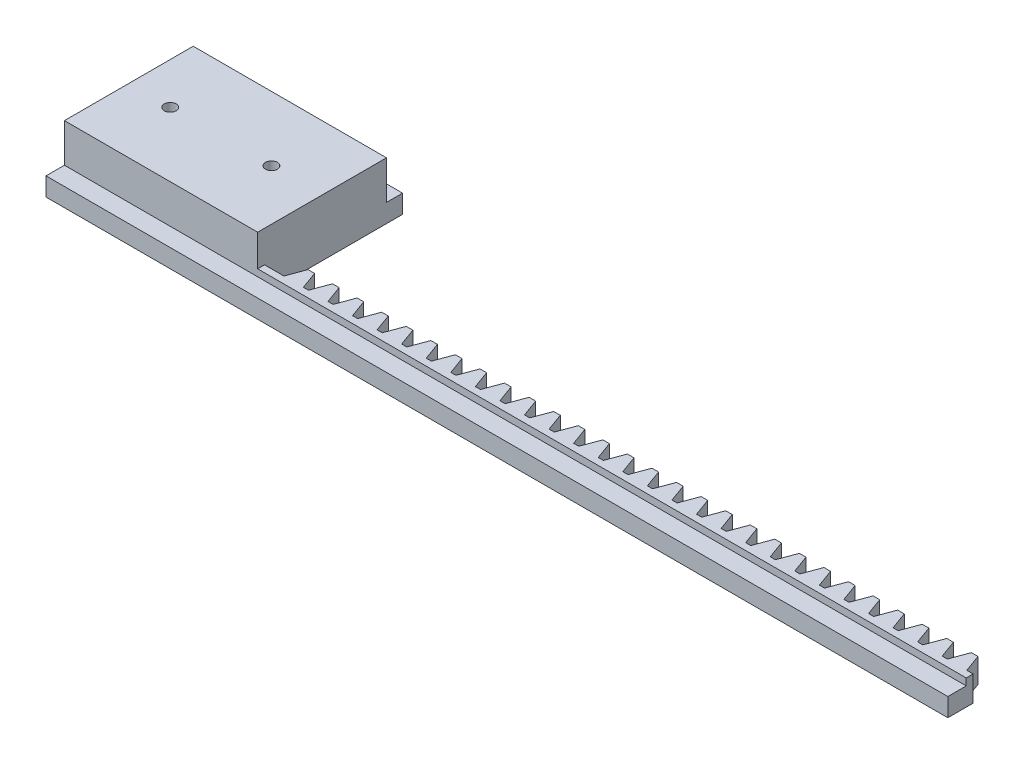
from build123d import *

# Parameters (mm, degrees)
BOSS_EXTRUDE1_DEPTH = 2.64
SKETCH2_W           = 154
SKETCH2_H           = 1.5
BOSS_EXTRUDE2_DEPTH = 0.22
SKETCH3_W           = 4
SKETCH3_H           = 4
BOSS_EXTRUDE3_DEPTH = 154
SKETCH10_W          = 42
SKETCH10_H          = 35.5
BOSS_EXTRUDE7_DEPTH = 4
SKETCH11_W          = 42
SKETCH11_H          = 28
BOSS_EXTRUDE8_DEPTH = 8.396
SKETCH12_R          = 1.3
CUT_EXTRUDE3_DEPTH  = 175.634042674


with BuildPart() as part:
    # Sketch1 → Boss-Extrude1 (new, symmetric)
    with BuildSketch(Plane(origin=(0, 0, 0), x_dir=(1, 0, 0), z_dir=(0, 1, 0))):
        Polygon((25, 1.7), (23.567498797, 1.7), (22.161556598, -2.125), (17.948749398, -2.125), (17.948749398, -3.625), (171.948749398, -3.625), (171.948749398, -2.125), (170.572186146, -2.125), (169.18, 1.7), (167.747498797, 1.7), (166.341556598, -2.125), (165.232186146, -2.125), (163.84, 1.7), (162.407498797, 1.7), (161.001556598, -2.125), (159.892186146, -2.125), (158.5, 1.7), (157.067498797, 1.7), (155.661556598, -2.125), (154.552186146, -2.125), (153.16, 1.7), (151.727498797, 1.7), (150.321556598, -2.125), (149.212186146, -2.125), (147.82, 1.7), (146.387498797, 1.7), (144.981556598, -2.125), (143.872186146, -2.125), (142.48, 1.7), (141.047498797, 1.7), (139.641556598, -2.125), (138.532186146, -2.125), (137.14, 1.7), (135.707498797, 1.7), (134.301556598, -2.125), (133.192186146, -2.125), (131.8, 1.7), (130.367498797, 1.7), (128.961556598, -2.125), (127.852186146, -2.125), (126.46, 1.7), (125.027498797, 1.7), (123.621556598, -2.125), (122.512186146, -2.125), (121.12, 1.7), (119.687498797, 1.7), (118.281556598, -2.125), (117.172186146, -2.125), (115.78, 1.7), (114.347498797, 1.7), (112.941556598, -2.125), (111.832186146, -2.125), (110.44, 1.7), (109.007498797, 1.7), (107.601556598, -2.125), (106.492186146, -2.125), (105.1, 1.7), (103.667498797, 1.7), (102.261556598, -2.125), (101.152186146, -2.125), (99.76, 1.7), (98.327498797, 1.7), (96.921556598, -2.125), (95.812186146, -2.125), (94.42, 1.7), (92.987498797, 1.7), (91.581556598, -2.125), (90.472186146, -2.125), (89.08, 1.7), (87.647498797, 1.7), (86.241556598, -2.125), (85.132186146, -2.125), (83.74, 1.7), (82.307498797, 1.7), (80.901556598, -2.125), (79.792186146, -2.125), (78.4, 1.7), (76.967498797, 1.7), (75.561556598, -2.125), (74.452186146, -2.125), (73.06, 1.7), (71.627498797, 1.7), (70.221556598, -2.125), (69.112186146, -2.125), (67.72, 1.7), (66.287498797, 1.7), (64.881556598, -2.125), (63.772186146, -2.125), (62.38, 1.7), (60.947498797, 1.7), (59.541556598, -2.125), (58.432186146, -2.125), (57.04, 1.7), (55.607498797, 1.7), (54.201556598, -2.125), (53.092186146, -2.125), (51.7, 1.7), (50.267498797, 1.7), (48.861556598, -2.125), (47.752186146, -2.125), (46.36, 1.7), (44.927498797, 1.7), (43.521556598, -2.125), (42.412186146, -2.125), (41.02, 1.7), (39.587498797, 1.7), (38.181556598, -2.125), (37.072186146, -2.125), (35.68, 1.7), (34.247498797, 1.7), (32.841556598, -2.125), (31.732186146, -2.125), (30.34, 1.7), (28.907498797, 1.7), (27.501556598, -2.125), (26.392186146, -2.125), align=None)
    extrude(amount=BOSS_EXTRUDE1_DEPTH, both=True)

    # Sketch2 → Boss-Extrude2 (add)
    with BuildSketch(Plane.XZ.offset(2.64)):
        with Locations((94.948749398, 2.875)):
            Rectangle(SKETCH2_W, SKETCH2_H)
    extrude(amount=BOSS_EXTRUDE2_DEPTH)

    # Sketch3 → Boss-Extrude3 (add)
    with BuildSketch(Plane(origin=(171.948749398, 0, 0), x_dir=(0, 0, -1), z_dir=(1, 0, 0))):
        with Locations((-5.625, -0.86)):
            Rectangle(SKETCH3_W, SKETCH3_H)
    extrude(amount=-BOSS_EXTRUDE3_DEPTH)

    # Sketch10 → Boss-Extrude7 (add)
    with BuildSketch(Plane.XZ.offset(2.86)):
        with Locations((-3.051250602, -10.125)):
            Rectangle(SKETCH10_W, SKETCH10_H)
    extrude(amount=-BOSS_EXTRUDE7_DEPTH)

    # Sketch11 → Boss-Extrude8 (add)
    with BuildSketch(Plane(origin=(0, 1.14, 0), x_dir=(1, 0, 0), z_dir=(0, 1, 0))):
        with Locations((-3.051250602, 10.375)):
            Rectangle(SKETCH11_W, SKETCH11_H)
    extrude(amount=BOSS_EXTRUDE8_DEPTH)

    # Sketch12 → Cut-Extrude3 (cut, through all)
    with BuildSketch(Plane(origin=(0, 9.536, 0), x_dir=(1, 0, 0), z_dir=(0, 1, 0))):
        with Locations(Location((-15.051250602, 10.375, 0), (0, 0, 270))):
            Circle(SKETCH12_R)
        with Locations(Location((6.948749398, 10.375, 0), (0, 0, 270))):
            Circle(SKETCH12_R)
    extrude(amount=-CUT_EXTRUDE3_DEPTH, mode=Mode.SUBTRACT)


solid = part.part
